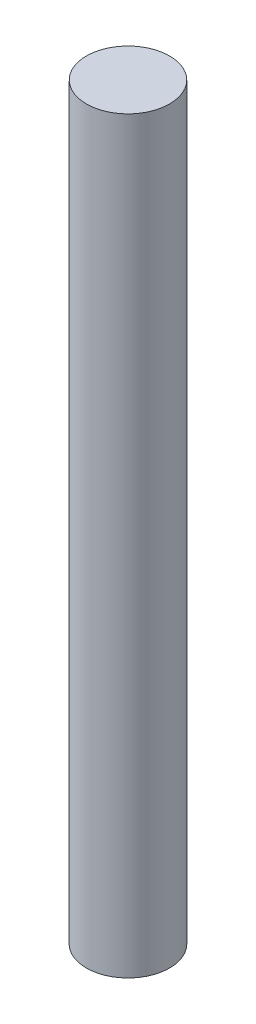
ISO-10303-21;
HEADER;
FILE_DESCRIPTION(('STEP AP214'),'2;1');
FILE_NAME('part.step','',(''),(''),'','','');
FILE_SCHEMA(('AUTOMOTIVE_DESIGN { 1 0 10303 214 1 1 1 1 }'));
ENDSEC;
DATA;
#1=APPLICATION_CONTEXT('core data for automotive mechanical design processes');
#2=APPLICATION_PROTOCOL_DEFINITION('international standard','automotive_design',2000,#1);
#3=PRODUCT_CONTEXT('',#1,'mechanical');
#4=PRODUCT('Part','Part','',(#3));
#5=PRODUCT_RELATED_PRODUCT_CATEGORY('part','',(#4));
#6=PRODUCT_DEFINITION_FORMATION('','',#4);
#7=PRODUCT_DEFINITION_CONTEXT('part definition',#1,'design');
#8=PRODUCT_DEFINITION('design','',#6,#7);
#9=PRODUCT_DEFINITION_SHAPE('','',#8);
#10=(LENGTH_UNIT() NAMED_UNIT(*) SI_UNIT(.MILLI.,.METRE.));
#11=(NAMED_UNIT(*) PLANE_ANGLE_UNIT() SI_UNIT($,.RADIAN.));
#12=(NAMED_UNIT(*) SI_UNIT($,.STERADIAN.) SOLID_ANGLE_UNIT());
#13=UNCERTAINTY_MEASURE_WITH_UNIT(LENGTH_MEASURE(1.E-05),#10,'distance_accuracy_value','');
#14=(GEOMETRIC_REPRESENTATION_CONTEXT(3) GLOBAL_UNCERTAINTY_ASSIGNED_CONTEXT((#13)) GLOBAL_UNIT_ASSIGNED_CONTEXT((#10,
#11,#12)) REPRESENTATION_CONTEXT('',''));
#15=CARTESIAN_POINT('',(0.,0.,0.));
#16=DIRECTION('',(0.,0.,1.));
#17=DIRECTION('',(1.,0.,0.));
#18=AXIS2_PLACEMENT_3D('',#15,#16,#17);
#19=CARTESIAN_POINT('',(0.,4.5,0.));
#20=DIRECTION('',(0.,-1.,0.));
#21=DIRECTION('',(0.,0.,-1.));
#22=AXIS2_PLACEMENT_3D('',#19,#20,#21);
#23=CYLINDRICAL_SURFACE('',#22,0.25);
#24=CARTESIAN_POINT('',(0.,4.5,0.));
#25=DIRECTION('',(0.,1.,0.));
#26=DIRECTION('',(0.,0.,1.));
#27=AXIS2_PLACEMENT_3D('',#24,#25,#26);
#28=CIRCLE('',#27,0.25);
#29=CARTESIAN_POINT('',(0.,4.5,0.25));
#30=VERTEX_POINT('',#29);
#31=EDGE_CURVE('E10',#30,#30,#28,.T.);
#32=ORIENTED_EDGE('',*,*,#31,.F.);
#33=EDGE_LOOP('',(#32));
#34=FACE_BOUND('',#33,.T.);
#35=CARTESIAN_POINT('',(0.,0.,0.));
#36=DIRECTION('',(0.,1.,0.));
#37=DIRECTION('',(0.,0.,1.));
#38=AXIS2_PLACEMENT_3D('',#35,#36,#37);
#39=CIRCLE('',#38,0.25);
#40=CARTESIAN_POINT('',(0.,0.,0.25));
#41=VERTEX_POINT('',#40);
#42=EDGE_CURVE('E37',#41,#41,#39,.T.);
#43=ORIENTED_EDGE('',*,*,#42,.T.);
#44=EDGE_LOOP('',(#43));
#45=FACE_BOUND('',#44,.T.);
#46=ADVANCED_FACE('F31',(#34,#45),#23,.T.);
#47=CARTESIAN_POINT('',(0.,4.5,0.));
#48=DIRECTION('',(0.,1.,0.));
#49=DIRECTION('',(0.,0.,1.));
#50=AXIS2_PLACEMENT_3D('',#47,#48,#49);
#51=PLANE('',#50);
#52=ORIENTED_EDGE('',*,*,#31,.T.);
#53=EDGE_LOOP('',(#52));
#54=FACE_BOUND('',#53,.T.);
#55=ADVANCED_FACE('F46',(#54),#51,.T.);
#56=CARTESIAN_POINT('',(0.,0.,0.));
#57=DIRECTION('',(0.,1.,0.));
#58=DIRECTION('',(0.,0.,1.));
#59=AXIS2_PLACEMENT_3D('',#56,#57,#58);
#60=PLANE('',#59);
#61=ORIENTED_EDGE('',*,*,#42,.F.);
#62=EDGE_LOOP('',(#61));
#63=FACE_BOUND('',#62,.T.);
#64=ADVANCED_FACE('F44',(#63),#60,.F.);
#65=CLOSED_SHELL('',(#46,#55,#64));
#66=MANIFOLD_SOLID_BREP('B2',#65);
#67=ADVANCED_BREP_SHAPE_REPRESENTATION('',(#18,#66),#14);
#68=SHAPE_DEFINITION_REPRESENTATION(#9,#67);
ENDSEC;
END-ISO-10303-21;
